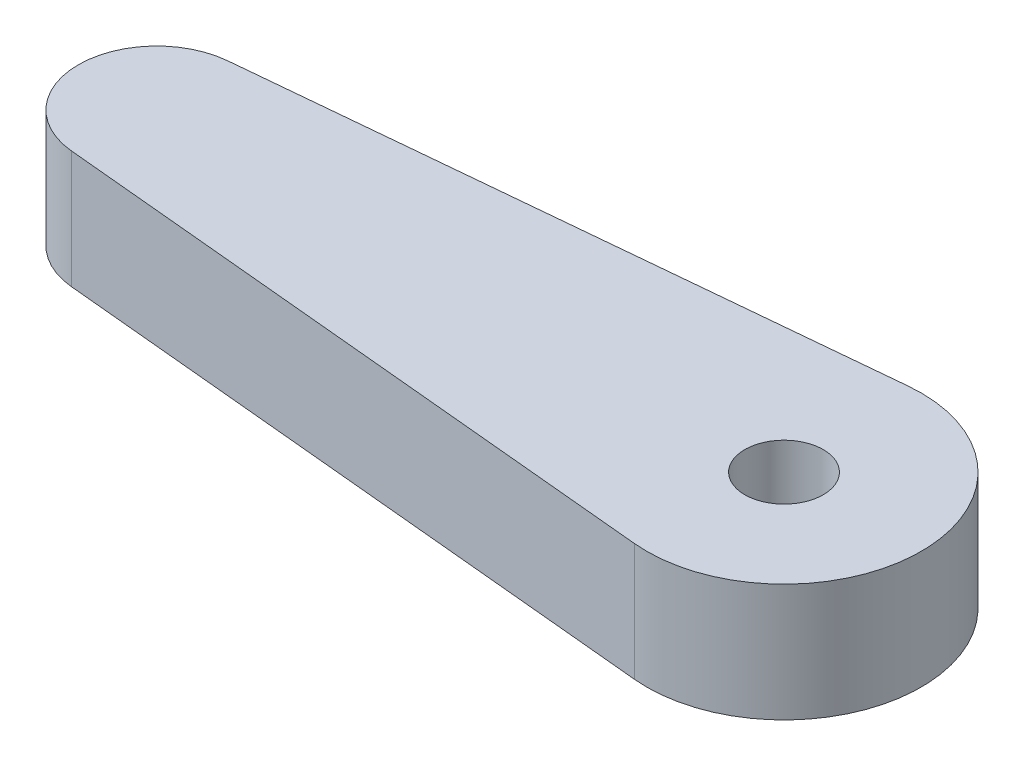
from build123d import *

# Parameters (mm, degrees)
BOSS_EXTRUDE1_DEPTH = 15
SKETCH4_R           = 5
CUT_EXTRUDE1_DEPTH  = 15


with BuildPart() as part:
    # Sketch1 → Boss-Extrude1 (new body)
    with BuildSketch(Plane(origin=(0, 0, 0), x_dir=(1, 0, 0), z_dir=(0, 1, 0))):
        with BuildLine():
            Line((-0.9375, 9.955957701), (78.359375, 17.422925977))
            ThreePointArc((78.359375, 17.422925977), (97.5, 0), (78.359375, -17.422925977))
            Line((78.359375, -17.422925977), (-0.9375, -9.955957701))
            ThreePointArc((-0.9375, -9.955957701), (-10, 0), (-0.9375, 9.955957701))
        make_face()
    extrude(amount=BOSS_EXTRUDE1_DEPTH)

    # Sketch4 → Cut-Extrude1 (cut)
    with BuildSketch(Plane(origin=(0, 15, 0), x_dir=(1, 0, 0), z_dir=(0, 1, 0))):
        with Locations(Location((80, 0, 0), (0, 0, 270))):
            Circle(SKETCH4_R)
    extrude(amount=-CUT_EXTRUDE1_DEPTH, mode=Mode.SUBTRACT)

    # Sketch5 → Cut-Revolve3 (revolve, cut)
    with BuildSketch(Plane(origin=(0, 0, 0), x_dir=(0, 0, -1), z_dir=(1, 0, 0))):
        with BuildLine():
            Line((0, 0), (0, 7.5))
            ThreePointArc((0, 7.5), (5.303300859, 5.303300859), (7.5, 0))
            Line((7.5, 0), (0, 0))
        make_face()
    revolve(axis=Axis((0, -6.428501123, 0), (0, 1, 0)), mode=Mode.SUBTRACT)


solid = part.part
